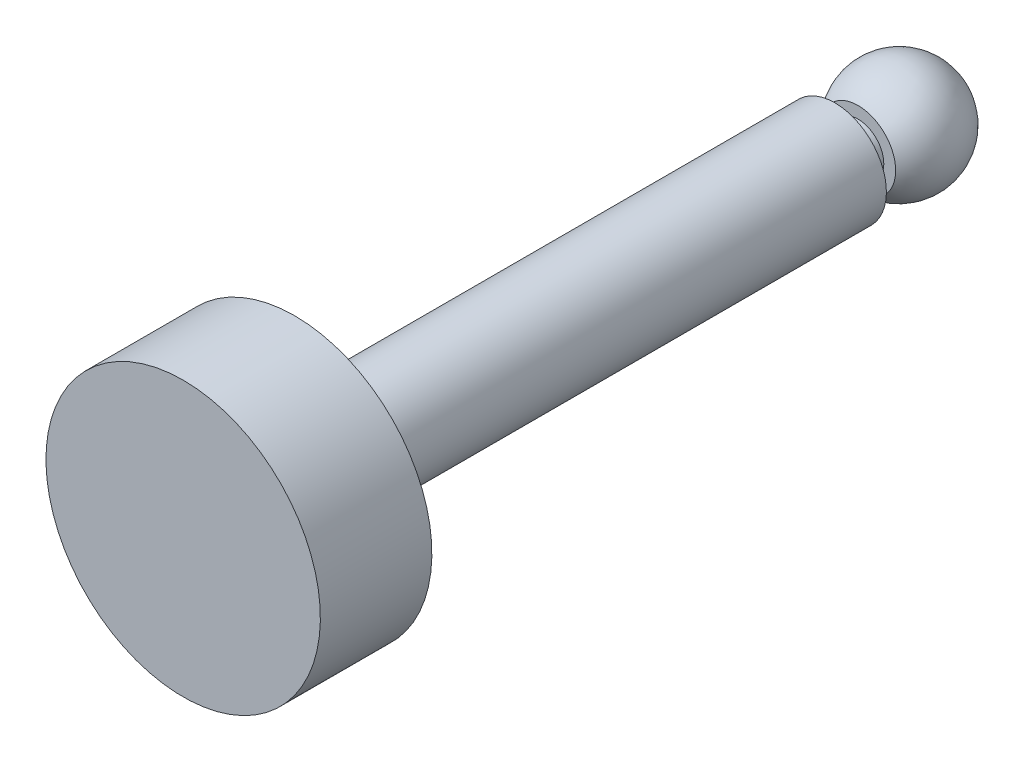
ISO-10303-21;
HEADER;
FILE_DESCRIPTION(('STEP AP214'),'2;1');
FILE_NAME('part.step','',(''),(''),'','','');
FILE_SCHEMA(('AUTOMOTIVE_DESIGN { 1 0 10303 214 1 1 1 1 }'));
ENDSEC;
DATA;
#1=APPLICATION_CONTEXT('core data for automotive mechanical design processes');
#2=APPLICATION_PROTOCOL_DEFINITION('international standard','automotive_design',2000,#1);
#3=PRODUCT_CONTEXT('',#1,'mechanical');
#4=PRODUCT('Part','Part','',(#3));
#5=PRODUCT_RELATED_PRODUCT_CATEGORY('part','',(#4));
#6=PRODUCT_DEFINITION_FORMATION('','',#4);
#7=PRODUCT_DEFINITION_CONTEXT('part definition',#1,'design');
#8=PRODUCT_DEFINITION('design','',#6,#7);
#9=PRODUCT_DEFINITION_SHAPE('','',#8);
#10=(LENGTH_UNIT() NAMED_UNIT(*) SI_UNIT(.MILLI.,.METRE.));
#11=(NAMED_UNIT(*) PLANE_ANGLE_UNIT() SI_UNIT($,.RADIAN.));
#12=(NAMED_UNIT(*) SI_UNIT($,.STERADIAN.) SOLID_ANGLE_UNIT());
#13=UNCERTAINTY_MEASURE_WITH_UNIT(LENGTH_MEASURE(1.E-05),#10,'distance_accuracy_value','');
#14=(GEOMETRIC_REPRESENTATION_CONTEXT(3) GLOBAL_UNCERTAINTY_ASSIGNED_CONTEXT((#13)) GLOBAL_UNIT_ASSIGNED_CONTEXT((#10,
#11,#12)) REPRESENTATION_CONTEXT('',''));
#15=CARTESIAN_POINT('',(0.,0.,0.));
#16=DIRECTION('',(0.,0.,1.));
#17=DIRECTION('',(1.,0.,0.));
#18=AXIS2_PLACEMENT_3D('',#15,#16,#17);
#19=CARTESIAN_POINT('',(0.,-16.,90.));
#20=DIRECTION('',(0.,0.,-1.));
#21=DIRECTION('',(0.,-1.,0.));
#22=AXIS2_PLACEMENT_3D('',#19,#20,#21);
#23=PLANE('',#22);
#24=CARTESIAN_POINT('',(0.,0.,90.));
#25=DIRECTION('',(0.,0.,1.));
#26=DIRECTION('',(0.,1.,0.));
#27=AXIS2_PLACEMENT_3D('',#24,#25,#26);
#28=CIRCLE('',#27,16.);
#29=CARTESIAN_POINT('',(0.,16.,90.));
#30=VERTEX_POINT('',#29);
#31=EDGE_CURVE('E37',#30,#30,#28,.T.);
#32=ORIENTED_EDGE('',*,*,#31,.T.);
#33=EDGE_LOOP('',(#32));
#34=FACE_BOUND('',#33,.T.);
#35=ADVANCED_FACE('F12',(#34),#23,.F.);
#36=CARTESIAN_POINT('',(0.,0.,6.5));
#37=DIRECTION('',(0.,-1.,0.));
#38=DIRECTION('',(-1.,0.,0.));
#39=AXIS2_PLACEMENT_3D('',#36,#37,#38);
#40=SPHERICAL_SURFACE('',#39,6.5);
#41=CARTESIAN_POINT('',(0.,0.,6.5));
#42=DIRECTION('',(0.,0.,1.));
#43=DIRECTION('',(0.,1.,0.));
#44=AXIS2_PLACEMENT_3D('',#41,#42,#43);
#45=SPHERICAL_SURFACE('',#44,6.5);
#46=CARTESIAN_POINT('',(0.,0.,11.3));
#47=DIRECTION('',(0.,0.,1.));
#48=DIRECTION('',(0.,1.,0.));
#49=AXIS2_PLACEMENT_3D('',#46,#47,#48);
#50=CIRCLE('',#49,4.38292140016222);
#51=CARTESIAN_POINT('',(0.,4.38292140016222,11.3));
#52=VERTEX_POINT('',#51);
#53=EDGE_CURVE('E8',#52,#52,#50,.T.);
#54=ORIENTED_EDGE('',*,*,#53,.F.);
#55=EDGE_LOOP('',(#54));
#56=FACE_BOUND('',#55,.T.);
#57=ADVANCED_FACE('F67',(#56),#45,.T.);
#58=CARTESIAN_POINT('',(0.,-4.38292140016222,11.3));
#59=DIRECTION('',(0.,0.,-1.));
#60=DIRECTION('',(0.,-1.,0.));
#61=AXIS2_PLACEMENT_3D('',#58,#59,#60);
#62=PLANE('',#61);
#63=CARTESIAN_POINT('',(0.,0.,11.3));
#64=DIRECTION('',(0.,0.,1.));
#65=DIRECTION('',(0.,1.,0.));
#66=AXIS2_PLACEMENT_3D('',#63,#64,#65);
#67=CIRCLE('',#66,3.);
#68=CARTESIAN_POINT('',(0.,3.,11.3));
#69=VERTEX_POINT('',#68);
#70=EDGE_CURVE('E18',#69,#69,#67,.T.);
#71=ORIENTED_EDGE('',*,*,#70,.F.);
#72=EDGE_LOOP('',(#71));
#73=FACE_BOUND('',#72,.T.);
#74=ORIENTED_EDGE('',*,*,#53,.T.);
#75=EDGE_LOOP('',(#74));
#76=FACE_BOUND('',#75,.T.);
#77=ADVANCED_FACE('F71',(#73,#76),#62,.F.);
#78=CARTESIAN_POINT('',(0.,0.,8.3));
#79=DIRECTION('',(0.,0.,1.));
#80=DIRECTION('',(0.,1.,0.));
#81=AXIS2_PLACEMENT_3D('',#78,#79,#80);
#82=CYLINDRICAL_SURFACE('',#81,3.);
#83=ORIENTED_EDGE('',*,*,#70,.T.);
#84=EDGE_LOOP('',(#83));
#85=FACE_BOUND('',#84,.T.);
#86=CARTESIAN_POINT('',(0.,0.,14.));
#87=DIRECTION('',(0.,0.,1.));
#88=DIRECTION('',(0.,1.,0.));
#89=AXIS2_PLACEMENT_3D('',#86,#87,#88);
#90=CIRCLE('',#89,3.);
#91=CARTESIAN_POINT('',(0.,3.,14.));
#92=VERTEX_POINT('',#91);
#93=EDGE_CURVE('E22',#92,#92,#90,.T.);
#94=ORIENTED_EDGE('',*,*,#93,.F.);
#95=EDGE_LOOP('',(#94));
#96=FACE_BOUND('',#95,.T.);
#97=ADVANCED_FACE('F63',(#85,#96),#82,.T.);
#98=CARTESIAN_POINT('',(0.,-6.,14.));
#99=DIRECTION('',(0.,0.,-1.));
#100=DIRECTION('',(0.,-1.,0.));
#101=AXIS2_PLACEMENT_3D('',#98,#99,#100);
#102=PLANE('',#101);
#103=ORIENTED_EDGE('',*,*,#93,.T.);
#104=EDGE_LOOP('',(#103));
#105=FACE_BOUND('',#104,.T.);
#106=CARTESIAN_POINT('',(0.,0.,14.));
#107=DIRECTION('',(0.,0.,1.));
#108=DIRECTION('',(0.,1.,0.));
#109=AXIS2_PLACEMENT_3D('',#106,#107,#108);
#110=CIRCLE('',#109,6.);
#111=CARTESIAN_POINT('',(0.,6.,14.));
#112=VERTEX_POINT('',#111);
#113=EDGE_CURVE('E26',#112,#112,#110,.T.);
#114=ORIENTED_EDGE('',*,*,#113,.F.);
#115=EDGE_LOOP('',(#114));
#116=FACE_BOUND('',#115,.T.);
#117=ADVANCED_FACE('F56',(#105,#116),#102,.T.);
#118=CARTESIAN_POINT('',(0.,0.,8.3));
#119=DIRECTION('',(0.,0.,1.));
#120=DIRECTION('',(0.,1.,0.));
#121=AXIS2_PLACEMENT_3D('',#118,#119,#120);
#122=CYLINDRICAL_SURFACE('',#121,6.);
#123=ORIENTED_EDGE('',*,*,#113,.T.);
#124=EDGE_LOOP('',(#123));
#125=FACE_BOUND('',#124,.T.);
#126=CARTESIAN_POINT('',(0.,0.,77.));
#127=DIRECTION('',(0.,0.,1.));
#128=DIRECTION('',(0.,1.,0.));
#129=AXIS2_PLACEMENT_3D('',#126,#127,#128);
#130=CIRCLE('',#129,6.);
#131=CARTESIAN_POINT('',(0.,6.,77.));
#132=VERTEX_POINT('',#131);
#133=EDGE_CURVE('E31',#132,#132,#130,.T.);
#134=ORIENTED_EDGE('',*,*,#133,.F.);
#135=EDGE_LOOP('',(#134));
#136=FACE_BOUND('',#135,.T.);
#137=ADVANCED_FACE('F51',(#125,#136),#122,.T.);
#138=CARTESIAN_POINT('',(0.,-6.,77.));
#139=DIRECTION('',(0.,0.,1.));
#140=DIRECTION('',(0.,1.,0.));
#141=AXIS2_PLACEMENT_3D('',#138,#139,#140);
#142=PLANE('',#141);
#143=CARTESIAN_POINT('',(0.,0.,77.));
#144=DIRECTION('',(0.,0.,1.));
#145=DIRECTION('',(0.,1.,0.));
#146=AXIS2_PLACEMENT_3D('',#143,#144,#145);
#147=CIRCLE('',#146,16.);
#148=CARTESIAN_POINT('',(0.,16.,77.));
#149=VERTEX_POINT('',#148);
#150=EDGE_CURVE('E34',#149,#149,#147,.T.);
#151=ORIENTED_EDGE('',*,*,#150,.F.);
#152=EDGE_LOOP('',(#151));
#153=FACE_BOUND('',#152,.T.);
#154=ORIENTED_EDGE('',*,*,#133,.T.);
#155=EDGE_LOOP('',(#154));
#156=FACE_BOUND('',#155,.T.);
#157=ADVANCED_FACE('F45',(#153,#156),#142,.F.);
#158=CARTESIAN_POINT('',(0.,0.,8.3));
#159=DIRECTION('',(0.,0.,1.));
#160=DIRECTION('',(0.,1.,0.));
#161=AXIS2_PLACEMENT_3D('',#158,#159,#160);
#162=CYLINDRICAL_SURFACE('',#161,16.);
#163=ORIENTED_EDGE('',*,*,#31,.F.);
#164=EDGE_LOOP('',(#163));
#165=FACE_BOUND('',#164,.T.);
#166=ORIENTED_EDGE('',*,*,#150,.T.);
#167=EDGE_LOOP('',(#166));
#168=FACE_BOUND('',#167,.T.);
#169=ADVANCED_FACE('F42',(#165,#168),#162,.T.);
#170=CLOSED_SHELL('',(#35,#57,#77,#97,#117,#137,#157,#169));
#171=MANIFOLD_SOLID_BREP('B1',#170);
#172=ADVANCED_BREP_SHAPE_REPRESENTATION('',(#18,#171),#14);
#173=SHAPE_DEFINITION_REPRESENTATION(#9,#172);
ENDSEC;
END-ISO-10303-21;
